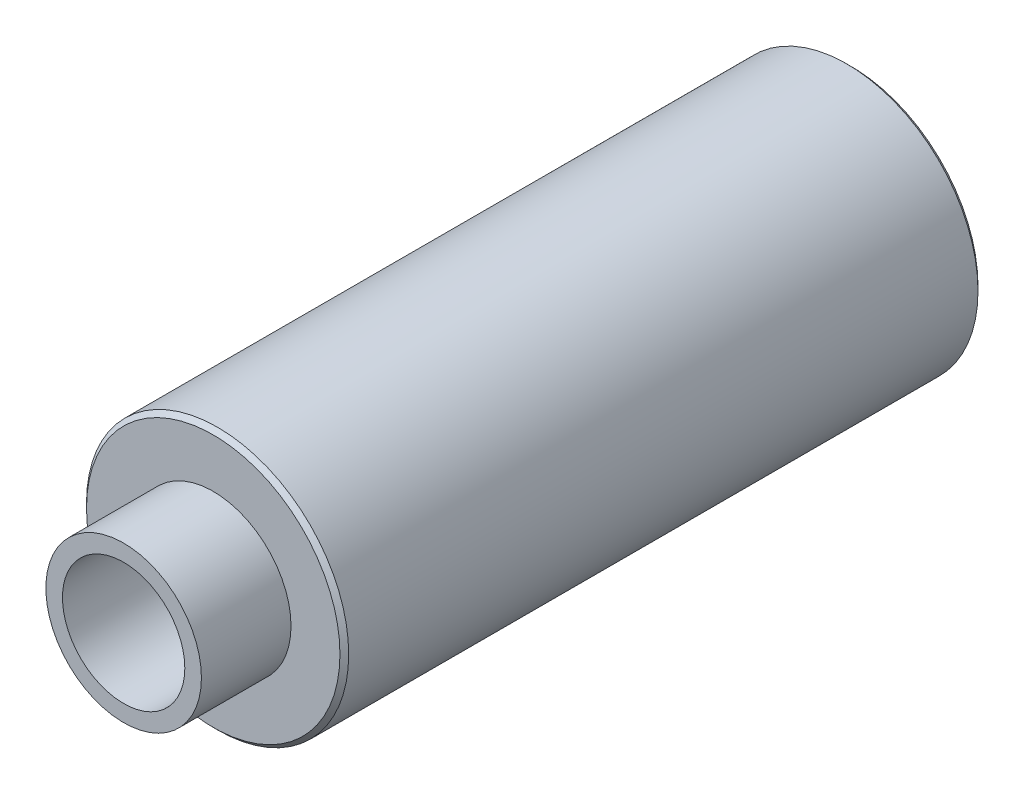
ISO-10303-21;
HEADER;
FILE_DESCRIPTION(('STEP AP214'),'2;1');
FILE_NAME('part.step','',(''),(''),'','','');
FILE_SCHEMA(('AUTOMOTIVE_DESIGN { 1 0 10303 214 1 1 1 1 }'));
ENDSEC;
DATA;
#1=APPLICATION_CONTEXT('core data for automotive mechanical design processes');
#2=APPLICATION_PROTOCOL_DEFINITION('international standard','automotive_design',2000,#1);
#3=PRODUCT_CONTEXT('',#1,'mechanical');
#4=PRODUCT('Part','Part','',(#3));
#5=PRODUCT_RELATED_PRODUCT_CATEGORY('part','',(#4));
#6=PRODUCT_DEFINITION_FORMATION('','',#4);
#7=PRODUCT_DEFINITION_CONTEXT('part definition',#1,'design');
#8=PRODUCT_DEFINITION('design','',#6,#7);
#9=PRODUCT_DEFINITION_SHAPE('','',#8);
#10=(LENGTH_UNIT() NAMED_UNIT(*) SI_UNIT(.MILLI.,.METRE.));
#11=(NAMED_UNIT(*) PLANE_ANGLE_UNIT() SI_UNIT($,.RADIAN.));
#12=(NAMED_UNIT(*) SI_UNIT($,.STERADIAN.) SOLID_ANGLE_UNIT());
#13=UNCERTAINTY_MEASURE_WITH_UNIT(LENGTH_MEASURE(1.E-05),#10,'distance_accuracy_value','');
#14=(GEOMETRIC_REPRESENTATION_CONTEXT(3) GLOBAL_UNCERTAINTY_ASSIGNED_CONTEXT((#13)) GLOBAL_UNIT_ASSIGNED_CONTEXT((#10,
#11,#12)) REPRESENTATION_CONTEXT('',''));
#15=CARTESIAN_POINT('',(0.,0.,0.));
#16=DIRECTION('',(0.,0.,1.));
#17=DIRECTION('',(1.,0.,0.));
#18=AXIS2_PLACEMENT_3D('',#15,#16,#17);
#19=CARTESIAN_POINT('',(0.,2.8,28.6));
#20=DIRECTION('',(0.,0.,-1.));
#21=DIRECTION('',(-1.,0.,0.));
#22=AXIS2_PLACEMENT_3D('',#19,#20,#21);
#23=PLANE('',#22);
#24=CARTESIAN_POINT('',(0.,0.,28.6));
#25=DIRECTION('',(0.,0.,1.));
#26=DIRECTION('',(1.,0.,0.));
#27=AXIS2_PLACEMENT_3D('',#24,#25,#26);
#28=CIRCLE('',#27,2.8);
#29=CARTESIAN_POINT('',(2.8,0.,28.6));
#30=VERTEX_POINT('',#29);
#31=EDGE_CURVE('E17',#30,#30,#28,.T.);
#32=ORIENTED_EDGE('',*,*,#31,.T.);
#33=EDGE_LOOP('',(#32));
#34=FACE_BOUND('',#33,.T.);
#35=CARTESIAN_POINT('',(0.,0.,28.6));
#36=DIRECTION('',(0.,0.,1.));
#37=DIRECTION('',(1.,0.,0.));
#38=AXIS2_PLACEMENT_3D('',#35,#36,#37);
#39=CIRCLE('',#38,4.6);
#40=CARTESIAN_POINT('',(4.6,0.,28.6));
#41=VERTEX_POINT('',#40);
#42=EDGE_CURVE('E65',#41,#41,#39,.F.);
#43=ORIENTED_EDGE('',*,*,#42,.T.);
#44=EDGE_LOOP('',(#43));
#45=FACE_BOUND('',#44,.T.);
#46=ADVANCED_FACE('F14',(#34,#45),#23,.T.);
#47=CARTESIAN_POINT('',(0.,0.,17.05));
#48=DIRECTION('',(0.,0.,1.));
#49=DIRECTION('',(1.,0.,0.));
#50=AXIS2_PLACEMENT_3D('',#47,#48,#49);
#51=CYLINDRICAL_SURFACE('',#50,2.8);
#52=CARTESIAN_POINT('',(0.,0.,33.7));
#53=DIRECTION('',(0.,0.,1.));
#54=DIRECTION('',(1.,0.,0.));
#55=AXIS2_PLACEMENT_3D('',#52,#53,#54);
#56=CIRCLE('',#55,2.8);
#57=CARTESIAN_POINT('',(2.8,0.,33.7));
#58=VERTEX_POINT('',#57);
#59=EDGE_CURVE('E62',#58,#58,#56,.T.);
#60=ORIENTED_EDGE('',*,*,#59,.T.);
#61=EDGE_LOOP('',(#60));
#62=FACE_BOUND('',#61,.T.);
#63=ORIENTED_EDGE('',*,*,#31,.F.);
#64=EDGE_LOOP('',(#63));
#65=FACE_BOUND('',#64,.T.);
#66=ADVANCED_FACE('F77',(#62,#65),#51,.F.);
#67=CARTESIAN_POINT('',(0.,0.,17.05));
#68=DIRECTION('',(0.,0.,1.));
#69=DIRECTION('',(1.,0.,0.));
#70=AXIS2_PLACEMENT_3D('',#67,#68,#69);
#71=CYLINDRICAL_SURFACE('',#70,4.6);
#72=CARTESIAN_POINT('',(0.,0.,7.4));
#73=DIRECTION('',(0.,0.,1.));
#74=DIRECTION('',(1.,0.,0.));
#75=AXIS2_PLACEMENT_3D('',#72,#73,#74);
#76=CIRCLE('',#75,4.6);
#77=CARTESIAN_POINT('',(4.6,0.,7.4));
#78=VERTEX_POINT('',#77);
#79=EDGE_CURVE('E58',#78,#78,#76,.T.);
#80=ORIENTED_EDGE('',*,*,#79,.F.);
#81=EDGE_LOOP('',(#80));
#82=FACE_BOUND('',#81,.T.);
#83=ORIENTED_EDGE('',*,*,#42,.F.);
#84=EDGE_LOOP('',(#83));
#85=FACE_BOUND('',#84,.T.);
#86=ADVANCED_FACE('F79',(#82,#85),#71,.F.);
#87=CARTESIAN_POINT('',(0.,0.,33.7));
#88=DIRECTION('',(0.,0.,-1.));
#89=DIRECTION('',(-1.,0.,0.));
#90=AXIS2_PLACEMENT_3D('',#87,#88,#89);
#91=PLANE('',#90);
#92=ORIENTED_EDGE('',*,*,#59,.F.);
#93=EDGE_LOOP('',(#92));
#94=FACE_BOUND('',#93,.T.);
#95=CARTESIAN_POINT('',(0.,0.,33.7));
#96=DIRECTION('',(0.,0.,1.));
#97=DIRECTION('',(1.,0.,0.));
#98=AXIS2_PLACEMENT_3D('',#95,#96,#97);
#99=CIRCLE('',#98,3.56);
#100=CARTESIAN_POINT('',(3.56,0.,33.7));
#101=VERTEX_POINT('',#100);
#102=EDGE_CURVE('E54',#101,#101,#99,.F.);
#103=ORIENTED_EDGE('',*,*,#102,.F.);
#104=EDGE_LOOP('',(#103));
#105=FACE_BOUND('',#104,.T.);
#106=ADVANCED_FACE('F86',(#94,#105),#91,.F.);
#107=CARTESIAN_POINT('',(0.,4.975,7.4));
#108=DIRECTION('',(0.,0.,-1.));
#109=DIRECTION('',(-1.,0.,0.));
#110=AXIS2_PLACEMENT_3D('',#107,#108,#109);
#111=PLANE('',#110);
#112=ORIENTED_EDGE('',*,*,#79,.T.);
#113=EDGE_LOOP('',(#112));
#114=FACE_BOUND('',#113,.T.);
#115=CARTESIAN_POINT('',(0.,0.,7.4));
#116=DIRECTION('',(0.,0.,1.));
#117=DIRECTION('',(1.,0.,0.));
#118=AXIS2_PLACEMENT_3D('',#115,#116,#117);
#119=CIRCLE('',#118,4.975);
#120=CARTESIAN_POINT('',(4.975,0.,7.4));
#121=VERTEX_POINT('',#120);
#122=EDGE_CURVE('E50',#121,#121,#119,.F.);
#123=ORIENTED_EDGE('',*,*,#122,.T.);
#124=EDGE_LOOP('',(#123));
#125=FACE_BOUND('',#124,.T.);
#126=ADVANCED_FACE('F119',(#114,#125),#111,.T.);
#127=CARTESIAN_POINT('',(0.,0.,17.05));
#128=DIRECTION('',(0.,0.,1.));
#129=DIRECTION('',(1.,0.,0.));
#130=AXIS2_PLACEMENT_3D('',#127,#128,#129);
#131=CYLINDRICAL_SURFACE('',#130,3.56);
#132=CARTESIAN_POINT('',(0.,0.,29.6));
#133=DIRECTION('',(0.,0.,1.));
#134=DIRECTION('',(1.,0.,0.));
#135=AXIS2_PLACEMENT_3D('',#132,#133,#134);
#136=CIRCLE('',#135,3.56);
#137=CARTESIAN_POINT('',(3.56,0.,29.6));
#138=VERTEX_POINT('',#137);
#139=EDGE_CURVE('E46',#138,#138,#136,.T.);
#140=ORIENTED_EDGE('',*,*,#139,.T.);
#141=EDGE_LOOP('',(#140));
#142=FACE_BOUND('',#141,.T.);
#143=ORIENTED_EDGE('',*,*,#102,.T.);
#144=EDGE_LOOP('',(#143));
#145=FACE_BOUND('',#144,.T.);
#146=ADVANCED_FACE('F115',(#142,#145),#131,.T.);
#147=CARTESIAN_POINT('',(0.,0.,17.05));
#148=DIRECTION('',(0.,0.,1.));
#149=DIRECTION('',(1.,0.,0.));
#150=AXIS2_PLACEMENT_3D('',#147,#148,#149);
#151=CYLINDRICAL_SURFACE('',#150,4.975);
#152=ORIENTED_EDGE('',*,*,#122,.F.);
#153=EDGE_LOOP('',(#152));
#154=FACE_BOUND('',#153,.T.);
#155=CARTESIAN_POINT('',(0.,0.,0.400000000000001));
#156=DIRECTION('',(0.,0.,1.));
#157=DIRECTION('',(1.,0.,0.));
#158=AXIS2_PLACEMENT_3D('',#155,#156,#157);
#159=CIRCLE('',#158,4.975);
#160=CARTESIAN_POINT('',(4.975,0.,0.400000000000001));
#161=VERTEX_POINT('',#160);
#162=EDGE_CURVE('E42',#161,#161,#159,.T.);
#163=ORIENTED_EDGE('',*,*,#162,.F.);
#164=EDGE_LOOP('',(#163));
#165=FACE_BOUND('',#164,.T.);
#166=ADVANCED_FACE('F111',(#154,#165),#151,.F.);
#167=CARTESIAN_POINT('',(0.,3.56,29.6));
#168=DIRECTION('',(0.,0.,-1.));
#169=DIRECTION('',(-1.,0.,0.));
#170=AXIS2_PLACEMENT_3D('',#167,#168,#169);
#171=PLANE('',#170);
#172=ORIENTED_EDGE('',*,*,#139,.F.);
#173=EDGE_LOOP('',(#172));
#174=FACE_BOUND('',#173,.T.);
#175=CARTESIAN_POINT('',(0.,0.,29.6000000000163));
#176=DIRECTION('',(0.,0.,-1.));
#177=DIRECTION('',(-1.,0.,0.));
#178=AXIS2_PLACEMENT_3D('',#175,#176,#177);
#179=CIRCLE('',#178,5.80000000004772);
#180=CARTESIAN_POINT('',(-5.80000000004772,0.,29.6000000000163));
#181=VERTEX_POINT('',#180);
#182=EDGE_CURVE('E38',#181,#181,#179,.T.);
#183=ORIENTED_EDGE('',*,*,#182,.F.);
#184=EDGE_LOOP('',(#183));
#185=FACE_BOUND('',#184,.T.);
#186=ADVANCED_FACE('F107',(#174,#185),#171,.F.);
#187=CARTESIAN_POINT('',(0.,0.,0.4));
#188=DIRECTION('',(0.,0.,-1.));
#189=DIRECTION('',(-1.,0.,0.));
#190=AXIS2_PLACEMENT_3D('',#187,#188,#189);
#191=PLANE('',#190);
#192=ORIENTED_EDGE('',*,*,#162,.T.);
#193=EDGE_LOOP('',(#192));
#194=FACE_BOUND('',#193,.T.);
#195=CARTESIAN_POINT('',(0.,0.,0.399999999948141));
#196=DIRECTION('',(0.,0.,1.));
#197=DIRECTION('',(1.,0.,0.));
#198=AXIS2_PLACEMENT_3D('',#195,#196,#197);
#199=CIRCLE('',#198,5.79999999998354);
#200=CARTESIAN_POINT('',(5.79999999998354,0.,0.399999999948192));
#201=VERTEX_POINT('',#200);
#202=EDGE_CURVE('E30',#201,#201,#199,.T.);
#203=ORIENTED_EDGE('',*,*,#202,.F.);
#204=EDGE_LOOP('',(#203));
#205=FACE_BOUND('',#204,.T.);
#206=ADVANCED_FACE('F103',(#194,#205),#191,.T.);
#207=CARTESIAN_POINT('',(0.,0.,29.4000000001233));
#208=DIRECTION('',(0.,0.,-1.));
#209=DIRECTION('',(-1.,0.,0.));
#210=AXIS2_PLACEMENT_3D('',#207,#208,#209);
#211=CONICAL_SURFACE('',#210,5.99999999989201,0.785398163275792);
#212=ORIENTED_EDGE('',*,*,#182,.T.);
#213=EDGE_LOOP('',(#212));
#214=FACE_BOUND('',#213,.T.);
#215=CARTESIAN_POINT('',(0.,0.,29.4));
#216=DIRECTION('',(0.,0.,1.));
#217=DIRECTION('',(1.,0.,0.));
#218=AXIS2_PLACEMENT_3D('',#215,#216,#217);
#219=CIRCLE('',#218,6.);
#220=CARTESIAN_POINT('',(6.,0.,29.4));
#221=VERTEX_POINT('',#220);
#222=EDGE_CURVE('E22',#221,#221,#219,.F.);
#223=ORIENTED_EDGE('',*,*,#222,.F.);
#224=EDGE_LOOP('',(#223));
#225=FACE_BOUND('',#224,.T.);
#226=ADVANCED_FACE('F97',(#214,#225),#211,.T.);
#227=CARTESIAN_POINT('',(0.,0.,0.600000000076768));
#228=DIRECTION('',(0.,0.,1.));
#229=DIRECTION('',(1.,0.,0.));
#230=AXIS2_PLACEMENT_3D('',#227,#228,#229);
#231=CONICAL_SURFACE('',#230,6.00000000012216,0.785398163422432);
#232=ORIENTED_EDGE('',*,*,#202,.T.);
#233=EDGE_LOOP('',(#232));
#234=FACE_BOUND('',#233,.T.);
#235=CARTESIAN_POINT('',(0.,0.,0.6));
#236=DIRECTION('',(0.,0.,1.));
#237=DIRECTION('',(1.,0.,0.));
#238=AXIS2_PLACEMENT_3D('',#235,#236,#237);
#239=CIRCLE('',#238,6.);
#240=CARTESIAN_POINT('',(6.,0.,0.6));
#241=VERTEX_POINT('',#240);
#242=EDGE_CURVE('E10',#241,#241,#239,.T.);
#243=ORIENTED_EDGE('',*,*,#242,.F.);
#244=EDGE_LOOP('',(#243));
#245=FACE_BOUND('',#244,.T.);
#246=ADVANCED_FACE('F91',(#234,#245),#231,.T.);
#247=CARTESIAN_POINT('',(0.,0.,17.05));
#248=DIRECTION('',(0.,0.,1.));
#249=DIRECTION('',(1.,0.,0.));
#250=AXIS2_PLACEMENT_3D('',#247,#248,#249);
#251=CYLINDRICAL_SURFACE('',#250,6.);
#252=ORIENTED_EDGE('',*,*,#222,.T.);
#253=EDGE_LOOP('',(#252));
#254=FACE_BOUND('',#253,.T.);
#255=ORIENTED_EDGE('',*,*,#242,.T.);
#256=EDGE_LOOP('',(#255));
#257=FACE_BOUND('',#256,.T.);
#258=ADVANCED_FACE('F89',(#254,#257),#251,.T.);
#259=CLOSED_SHELL('',(#46,#66,#86,#106,#126,#146,#166,#186,#206,#226,#246,#258));
#260=MANIFOLD_SOLID_BREP('B1',#259);
#261=ADVANCED_BREP_SHAPE_REPRESENTATION('',(#18,#260),#14);
#262=SHAPE_DEFINITION_REPRESENTATION(#9,#261);
ENDSEC;
END-ISO-10303-21;
